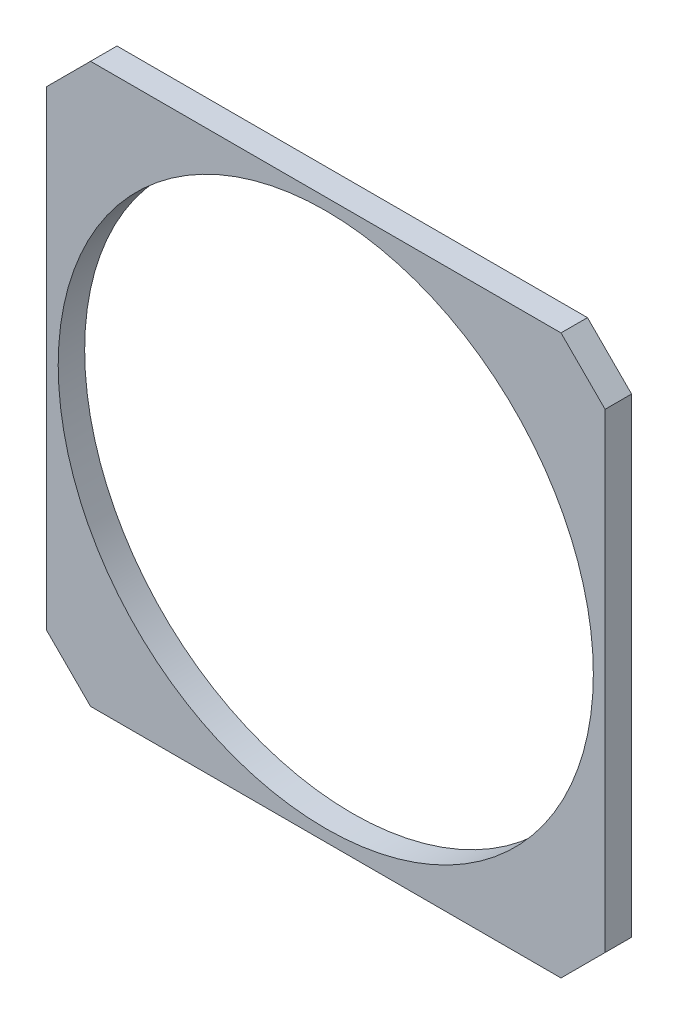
from build123d import *

# Parameters (mm, degrees)
SKETCH2_R           = 45.5
BOSS_EXTRUDE1_DEPTH = 4.5


with BuildPart() as part:
    # Sketch2 → Boss-Extrude1 (new body)
    with BuildSketch(Plane.XY):
        Polygon((-40, 47.5), (40, 47.5), (47.5, 40), (47.5, -40), (40, -47.5), (-40, -47.5), (-47.5, -40), (-47.5, 40), align=None)
        Circle(SKETCH2_R, mode=Mode.SUBTRACT)
    extrude(amount=BOSS_EXTRUDE1_DEPTH)


solid = part.part
